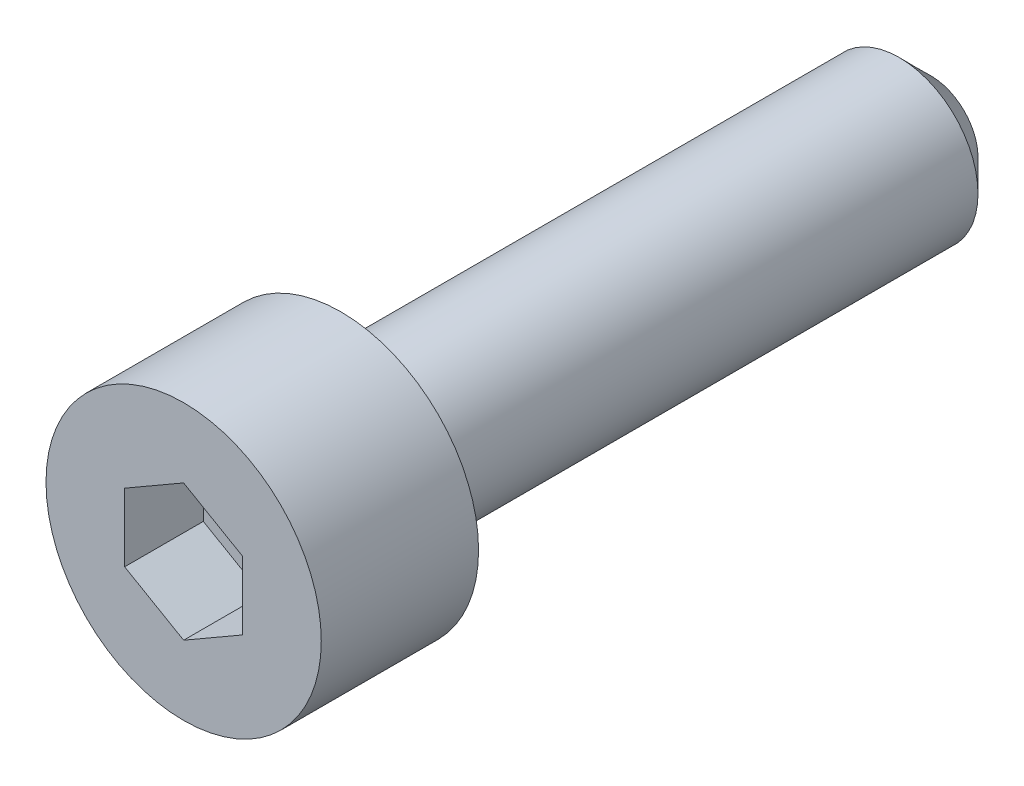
ISO-10303-21;
HEADER;
FILE_DESCRIPTION(('STEP AP214'),'2;1');
FILE_NAME('part.step','',(''),(''),'','','');
FILE_SCHEMA(('AUTOMOTIVE_DESIGN { 1 0 10303 214 1 1 1 1 }'));
ENDSEC;
DATA;
#1=APPLICATION_CONTEXT('core data for automotive mechanical design processes');
#2=APPLICATION_PROTOCOL_DEFINITION('international standard','automotive_design',2000,#1);
#3=PRODUCT_CONTEXT('',#1,'mechanical');
#4=PRODUCT('Part','Part','',(#3));
#5=PRODUCT_RELATED_PRODUCT_CATEGORY('part','',(#4));
#6=PRODUCT_DEFINITION_FORMATION('','',#4);
#7=PRODUCT_DEFINITION_CONTEXT('part definition',#1,'design');
#8=PRODUCT_DEFINITION('design','',#6,#7);
#9=PRODUCT_DEFINITION_SHAPE('','',#8);
#10=(LENGTH_UNIT() NAMED_UNIT(*) SI_UNIT(.MILLI.,.METRE.));
#11=(NAMED_UNIT(*) PLANE_ANGLE_UNIT() SI_UNIT($,.RADIAN.));
#12=(NAMED_UNIT(*) SI_UNIT($,.STERADIAN.) SOLID_ANGLE_UNIT());
#13=UNCERTAINTY_MEASURE_WITH_UNIT(LENGTH_MEASURE(1.E-05),#10,'distance_accuracy_value','');
#14=(GEOMETRIC_REPRESENTATION_CONTEXT(3) GLOBAL_UNCERTAINTY_ASSIGNED_CONTEXT((#13)) GLOBAL_UNIT_ASSIGNED_CONTEXT((#10,
#11,#12)) REPRESENTATION_CONTEXT('',''));
#15=CARTESIAN_POINT('',(0.,0.,0.));
#16=DIRECTION('',(0.,0.,1.));
#17=DIRECTION('',(1.,0.,0.));
#18=AXIS2_PLACEMENT_3D('',#15,#16,#17);
#19=CARTESIAN_POINT('',(0.,1.73205080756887,2.));
#20=DIRECTION('',(-0.5,-0.86602540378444,0.));
#21=DIRECTION('',(0.86602540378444,-0.5,0.));
#22=AXIS2_PLACEMENT_3D('',#19,#20,#21);
#23=PLANE('',#22);
#24=DIRECTION('',(0.,0.,1.));
#25=VECTOR('',#24,1.);
#26=CARTESIAN_POINT('',(1.5,0.866025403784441,2.));
#27=LINE('',#26,#25);
#28=CARTESIAN_POINT('',(1.5,0.866025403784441,2.));
#29=VERTEX_POINT('',#28);
#30=CARTESIAN_POINT('',(1.5,0.866025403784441,4.));
#31=VERTEX_POINT('',#30);
#32=EDGE_CURVE('E63',#29,#31,#27,.T.);
#33=ORIENTED_EDGE('',*,*,#32,.T.);
#34=DIRECTION('',(0.86602540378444,-0.5,0.));
#35=VECTOR('',#34,1.);
#36=CARTESIAN_POINT('',(0.,1.73205080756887,4.));
#37=LINE('',#36,#35);
#38=CARTESIAN_POINT('',(0.,1.73205080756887,4.));
#39=VERTEX_POINT('',#38);
#40=EDGE_CURVE('E29',#39,#31,#37,.T.);
#41=ORIENTED_EDGE('',*,*,#40,.F.);
#42=DIRECTION('',(0.,0.,1.));
#43=VECTOR('',#42,1.);
#44=CARTESIAN_POINT('',(0.,1.73205080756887,2.));
#45=LINE('',#44,#43);
#46=CARTESIAN_POINT('',(0.,1.73205080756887,2.));
#47=VERTEX_POINT('',#46);
#48=EDGE_CURVE('E33',#47,#39,#45,.T.);
#49=ORIENTED_EDGE('',*,*,#48,.F.);
#50=DIRECTION('',(0.86602540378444,-0.5,0.));
#51=VECTOR('',#50,1.);
#52=CARTESIAN_POINT('',(0.,1.73205080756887,2.));
#53=LINE('',#52,#51);
#54=EDGE_CURVE('E65',#47,#29,#53,.T.);
#55=ORIENTED_EDGE('',*,*,#54,.T.);
#56=EDGE_LOOP('',(#33,#41,#49,#55));
#57=FACE_BOUND('',#56,.T.);
#58=ADVANCED_FACE('F14',(#57),#23,.T.);
#59=CARTESIAN_POINT('',(1.5,-0.866025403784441,2.));
#60=DIRECTION('',(1.,0.,0.));
#61=DIRECTION('',(0.,1.,0.));
#62=AXIS2_PLACEMENT_3D('',#59,#60,#61);
#63=PLANE('',#62);
#64=DIRECTION('',(0.,0.,1.));
#65=VECTOR('',#64,1.);
#66=CARTESIAN_POINT('',(1.5,-0.866025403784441,2.));
#67=LINE('',#66,#65);
#68=CARTESIAN_POINT('',(1.5,-0.866025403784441,2.));
#69=VERTEX_POINT('',#68);
#70=CARTESIAN_POINT('',(1.5,-0.866025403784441,4.));
#71=VERTEX_POINT('',#70);
#72=EDGE_CURVE('E70',#69,#71,#67,.T.);
#73=ORIENTED_EDGE('',*,*,#72,.T.);
#74=DIRECTION('',(0.,1.,0.));
#75=VECTOR('',#74,1.);
#76=CARTESIAN_POINT('',(1.5,-0.866025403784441,4.));
#77=LINE('',#76,#75);
#78=EDGE_CURVE('E73',#71,#31,#77,.T.);
#79=ORIENTED_EDGE('',*,*,#78,.T.);
#80=ORIENTED_EDGE('',*,*,#32,.F.);
#81=DIRECTION('',(0.,1.,0.));
#82=VECTOR('',#81,1.);
#83=CARTESIAN_POINT('',(1.5,-0.866025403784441,2.));
#84=LINE('',#83,#82);
#85=EDGE_CURVE('E100',#69,#29,#84,.T.);
#86=ORIENTED_EDGE('',*,*,#85,.F.);
#87=EDGE_LOOP('',(#73,#79,#80,#86));
#88=FACE_BOUND('',#87,.T.);
#89=ADVANCED_FACE('F74',(#88),#63,.F.);
#90=CARTESIAN_POINT('',(0.,-1.73205080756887,2.));
#91=DIRECTION('',(0.5,-0.86602540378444,0.));
#92=DIRECTION('',(0.86602540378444,0.5,0.));
#93=AXIS2_PLACEMENT_3D('',#90,#91,#92);
#94=PLANE('',#93);
#95=DIRECTION('',(0.,0.,1.));
#96=VECTOR('',#95,1.);
#97=CARTESIAN_POINT('',(0.,-1.73205080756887,2.));
#98=LINE('',#97,#96);
#99=CARTESIAN_POINT('',(0.,-1.73205080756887,2.));
#100=VERTEX_POINT('',#99);
#101=CARTESIAN_POINT('',(0.,-1.73205080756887,4.));
#102=VERTEX_POINT('',#101);
#103=EDGE_CURVE('E108',#100,#102,#98,.T.);
#104=ORIENTED_EDGE('',*,*,#103,.T.);
#105=DIRECTION('',(0.86602540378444,0.5,0.));
#106=VECTOR('',#105,1.);
#107=CARTESIAN_POINT('',(0.,-1.73205080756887,4.));
#108=LINE('',#107,#106);
#109=EDGE_CURVE('E78',#102,#71,#108,.T.);
#110=ORIENTED_EDGE('',*,*,#109,.T.);
#111=ORIENTED_EDGE('',*,*,#72,.F.);
#112=DIRECTION('',(0.86602540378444,0.5,0.));
#113=VECTOR('',#112,1.);
#114=CARTESIAN_POINT('',(0.,-1.73205080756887,2.));
#115=LINE('',#114,#113);
#116=EDGE_CURVE('E97',#100,#69,#115,.T.);
#117=ORIENTED_EDGE('',*,*,#116,.F.);
#118=EDGE_LOOP('',(#104,#110,#111,#117));
#119=FACE_BOUND('',#118,.T.);
#120=ADVANCED_FACE('F139',(#119),#94,.F.);
#121=CARTESIAN_POINT('',(0.,-1.73205080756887,2.));
#122=DIRECTION('',(0.5,0.86602540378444,0.));
#123=DIRECTION('',(-0.86602540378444,0.5,0.));
#124=AXIS2_PLACEMENT_3D('',#121,#122,#123);
#125=PLANE('',#124);
#126=DIRECTION('',(0.,0.,1.));
#127=VECTOR('',#126,1.);
#128=CARTESIAN_POINT('',(-1.5,-0.866025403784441,2.));
#129=LINE('',#128,#127);
#130=CARTESIAN_POINT('',(-1.5,-0.866025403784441,2.));
#131=VERTEX_POINT('',#130);
#132=CARTESIAN_POINT('',(-1.5,-0.866025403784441,4.));
#133=VERTEX_POINT('',#132);
#134=EDGE_CURVE('E106',#131,#133,#129,.T.);
#135=ORIENTED_EDGE('',*,*,#134,.T.);
#136=DIRECTION('',(-0.86602540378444,0.5,0.));
#137=VECTOR('',#136,1.);
#138=CARTESIAN_POINT('',(0.,-1.73205080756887,4.));
#139=LINE('',#138,#137);
#140=EDGE_CURVE('E185',#102,#133,#139,.T.);
#141=ORIENTED_EDGE('',*,*,#140,.F.);
#142=ORIENTED_EDGE('',*,*,#103,.F.);
#143=DIRECTION('',(-0.86602540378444,0.5,0.));
#144=VECTOR('',#143,1.);
#145=CARTESIAN_POINT('',(0.,-1.73205080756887,2.));
#146=LINE('',#145,#144);
#147=EDGE_CURVE('E94',#100,#131,#146,.T.);
#148=ORIENTED_EDGE('',*,*,#147,.T.);
#149=EDGE_LOOP('',(#135,#141,#142,#148));
#150=FACE_BOUND('',#149,.T.);
#151=ADVANCED_FACE('F151',(#150),#125,.T.);
#152=CARTESIAN_POINT('',(-1.5,0.866025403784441,2.));
#153=DIRECTION('',(-1.,0.,0.));
#154=DIRECTION('',(0.,-1.,0.));
#155=AXIS2_PLACEMENT_3D('',#152,#153,#154);
#156=PLANE('',#155);
#157=DIRECTION('',(0.,0.,1.));
#158=VECTOR('',#157,1.);
#159=CARTESIAN_POINT('',(-1.5,0.866025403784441,2.));
#160=LINE('',#159,#158);
#161=CARTESIAN_POINT('',(-1.5,0.866025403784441,2.));
#162=VERTEX_POINT('',#161);
#163=CARTESIAN_POINT('',(-1.5,0.866025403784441,4.));
#164=VERTEX_POINT('',#163);
#165=EDGE_CURVE('E104',#162,#164,#160,.T.);
#166=ORIENTED_EDGE('',*,*,#165,.T.);
#167=DIRECTION('',(0.,-1.,0.));
#168=VECTOR('',#167,1.);
#169=CARTESIAN_POINT('',(-1.5,0.866025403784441,4.));
#170=LINE('',#169,#168);
#171=EDGE_CURVE('E186',#164,#133,#170,.T.);
#172=ORIENTED_EDGE('',*,*,#171,.T.);
#173=ORIENTED_EDGE('',*,*,#134,.F.);
#174=DIRECTION('',(0.,-1.,0.));
#175=VECTOR('',#174,1.);
#176=CARTESIAN_POINT('',(-1.5,0.866025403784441,2.));
#177=LINE('',#176,#175);
#178=EDGE_CURVE('E91',#162,#131,#177,.T.);
#179=ORIENTED_EDGE('',*,*,#178,.F.);
#180=EDGE_LOOP('',(#166,#172,#173,#179));
#181=FACE_BOUND('',#180,.T.);
#182=ADVANCED_FACE('F147',(#181),#156,.F.);
#183=CARTESIAN_POINT('',(0.,1.73205080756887,2.));
#184=DIRECTION('',(-0.5,0.86602540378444,0.));
#185=DIRECTION('',(-0.86602540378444,-0.5,0.));
#186=AXIS2_PLACEMENT_3D('',#183,#184,#185);
#187=PLANE('',#186);
#188=DIRECTION('',(-0.86602540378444,-0.5,0.));
#189=VECTOR('',#188,1.);
#190=CARTESIAN_POINT('',(0.,1.73205080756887,2.));
#191=LINE('',#190,#189);
#192=EDGE_CURVE('E88',#47,#162,#191,.T.);
#193=ORIENTED_EDGE('',*,*,#192,.F.);
#194=ORIENTED_EDGE('',*,*,#48,.T.);
#195=DIRECTION('',(-0.86602540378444,-0.5,0.));
#196=VECTOR('',#195,1.);
#197=CARTESIAN_POINT('',(0.,1.73205080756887,4.));
#198=LINE('',#197,#196);
#199=EDGE_CURVE('E84',#39,#164,#198,.T.);
#200=ORIENTED_EDGE('',*,*,#199,.T.);
#201=ORIENTED_EDGE('',*,*,#165,.F.);
#202=EDGE_LOOP('',(#193,#194,#200,#201));
#203=FACE_BOUND('',#202,.T.);
#204=ADVANCED_FACE('F144',(#203),#187,.F.);
#205=CARTESIAN_POINT('',(1.5,0.866025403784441,2.));
#206=DIRECTION('',(0.,0.,1.));
#207=DIRECTION('',(1.,0.,0.));
#208=AXIS2_PLACEMENT_3D('',#205,#206,#207);
#209=PLANE('',#208);
#210=ORIENTED_EDGE('',*,*,#54,.F.);
#211=ORIENTED_EDGE('',*,*,#192,.T.);
#212=ORIENTED_EDGE('',*,*,#178,.T.);
#213=ORIENTED_EDGE('',*,*,#147,.F.);
#214=ORIENTED_EDGE('',*,*,#116,.T.);
#215=ORIENTED_EDGE('',*,*,#85,.T.);
#216=EDGE_LOOP('',(#210,#211,#212,#213,#214,#215));
#217=FACE_BOUND('',#216,.T.);
#218=ADVANCED_FACE('F143',(#217),#209,.T.);
#219=CARTESIAN_POINT('',(0.,0.,4.));
#220=DIRECTION('',(0.,0.,1.));
#221=DIRECTION('',(1.,0.,0.));
#222=AXIS2_PLACEMENT_3D('',#219,#220,#221);
#223=PLANE('',#222);
#224=CARTESIAN_POINT('',(0.,0.,4.));
#225=DIRECTION('',(0.,0.,1.));
#226=DIRECTION('',(1.,0.,0.));
#227=AXIS2_PLACEMENT_3D('',#224,#225,#226);
#228=CIRCLE('',#227,3.5);
#229=CARTESIAN_POINT('',(3.5,0.,4.));
#230=VERTEX_POINT('',#229);
#231=EDGE_CURVE('E116',#230,#230,#228,.T.);
#232=ORIENTED_EDGE('',*,*,#231,.T.);
#233=EDGE_LOOP('',(#232));
#234=FACE_BOUND('',#233,.T.);
#235=ORIENTED_EDGE('',*,*,#199,.F.);
#236=ORIENTED_EDGE('',*,*,#40,.T.);
#237=ORIENTED_EDGE('',*,*,#78,.F.);
#238=ORIENTED_EDGE('',*,*,#109,.F.);
#239=ORIENTED_EDGE('',*,*,#140,.T.);
#240=ORIENTED_EDGE('',*,*,#171,.F.);
#241=EDGE_LOOP('',(#235,#236,#237,#238,#239,#240));
#242=FACE_BOUND('',#241,.T.);
#243=ADVANCED_FACE('F81',(#234,#242),#223,.T.);
#244=CARTESIAN_POINT('',(0.,0.,5.));
#245=DIRECTION('',(0.,0.,1.));
#246=DIRECTION('',(1.,0.,0.));
#247=AXIS2_PLACEMENT_3D('',#244,#245,#246);
#248=CYLINDRICAL_SURFACE('',#247,3.5);
#249=CARTESIAN_POINT('',(0.,0.,0.));
#250=DIRECTION('',(0.,0.,1.));
#251=DIRECTION('',(1.,0.,0.));
#252=AXIS2_PLACEMENT_3D('',#249,#250,#251);
#253=CIRCLE('',#252,3.5);
#254=CARTESIAN_POINT('',(3.5,0.,0.));
#255=VERTEX_POINT('',#254);
#256=EDGE_CURVE('E113',#255,#255,#253,.T.);
#257=ORIENTED_EDGE('',*,*,#256,.T.);
#258=EDGE_LOOP('',(#257));
#259=FACE_BOUND('',#258,.T.);
#260=ORIENTED_EDGE('',*,*,#231,.F.);
#261=EDGE_LOOP('',(#260));
#262=FACE_BOUND('',#261,.T.);
#263=ADVANCED_FACE('F164',(#259,#262),#248,.T.);
#264=CARTESIAN_POINT('',(3.5,0.,0.));
#265=DIRECTION('',(0.,0.,-1.));
#266=DIRECTION('',(-1.,0.,0.));
#267=AXIS2_PLACEMENT_3D('',#264,#265,#266);
#268=PLANE('',#267);
#269=CARTESIAN_POINT('',(0.,0.,0.));
#270=DIRECTION('',(0.,0.,1.));
#271=DIRECTION('',(1.,0.,0.));
#272=AXIS2_PLACEMENT_3D('',#269,#270,#271);
#273=CIRCLE('',#272,2.);
#274=CARTESIAN_POINT('',(2.,0.,0.));
#275=VERTEX_POINT('',#274);
#276=EDGE_CURVE('E69',#275,#275,#273,.T.);
#277=ORIENTED_EDGE('',*,*,#276,.T.);
#278=EDGE_LOOP('',(#277));
#279=FACE_BOUND('',#278,.T.);
#280=ORIENTED_EDGE('',*,*,#256,.F.);
#281=EDGE_LOOP('',(#280));
#282=FACE_BOUND('',#281,.T.);
#283=ADVANCED_FACE('F161',(#279,#282),#268,.T.);
#284=CARTESIAN_POINT('',(0.,0.,5.));
#285=DIRECTION('',(0.,0.,1.));
#286=DIRECTION('',(1.,0.,0.));
#287=AXIS2_PLACEMENT_3D('',#284,#285,#286);
#288=CYLINDRICAL_SURFACE('',#287,2.);
#289=CARTESIAN_POINT('',(0.,0.,-14.2));
#290=DIRECTION('',(0.,0.,-1.));
#291=DIRECTION('',(-1.,0.,0.));
#292=AXIS2_PLACEMENT_3D('',#289,#290,#291);
#293=CIRCLE('',#292,2.);
#294=CARTESIAN_POINT('',(-2.,0.,-14.2));
#295=VERTEX_POINT('',#294);
#296=EDGE_CURVE('E22',#295,#295,#293,.F.);
#297=ORIENTED_EDGE('',*,*,#296,.T.);
#298=EDGE_LOOP('',(#297));
#299=FACE_BOUND('',#298,.T.);
#300=ORIENTED_EDGE('',*,*,#276,.F.);
#301=EDGE_LOOP('',(#300));
#302=FACE_BOUND('',#301,.T.);
#303=ADVANCED_FACE('F121',(#299,#302),#288,.T.);
#304=CARTESIAN_POINT('',(2.,0.,-15.));
#305=DIRECTION('',(0.,0.,-1.));
#306=DIRECTION('',(-1.,0.,0.));
#307=AXIS2_PLACEMENT_3D('',#304,#305,#306);
#308=PLANE('',#307);
#309=CARTESIAN_POINT('',(0.,0.,-15.));
#310=DIRECTION('',(0.,0.,-1.));
#311=DIRECTION('',(-1.,0.,0.));
#312=AXIS2_PLACEMENT_3D('',#309,#310,#311);
#313=CIRCLE('',#312,1.2);
#314=CARTESIAN_POINT('',(-1.2,0.,-15.));
#315=VERTEX_POINT('',#314);
#316=EDGE_CURVE('E9',#315,#315,#313,.T.);
#317=ORIENTED_EDGE('',*,*,#316,.T.);
#318=EDGE_LOOP('',(#317));
#319=FACE_BOUND('',#318,.T.);
#320=ADVANCED_FACE('F125',(#319),#308,.T.);
#321=CARTESIAN_POINT('',(0.,0.,-14.2));
#322=DIRECTION('',(0.,0.,1.));
#323=DIRECTION('',(1.,0.,0.));
#324=AXIS2_PLACEMENT_3D('',#321,#322,#323);
#325=CONICAL_SURFACE('',#324,2.,0.785398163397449);
#326=ORIENTED_EDGE('',*,*,#316,.F.);
#327=EDGE_LOOP('',(#326));
#328=FACE_BOUND('',#327,.T.);
#329=ORIENTED_EDGE('',*,*,#296,.F.);
#330=EDGE_LOOP('',(#329));
#331=FACE_BOUND('',#330,.T.);
#332=ADVANCED_FACE('F16',(#328,#331),#325,.T.);
#333=CLOSED_SHELL('',(#58,#89,#120,#151,#182,#204,#218,#243,#263,#283,#303,#320,#332));
#334=MANIFOLD_SOLID_BREP('B1',#333);
#335=ADVANCED_BREP_SHAPE_REPRESENTATION('',(#18,#334),#14);
#336=SHAPE_DEFINITION_REPRESENTATION(#9,#335);
ENDSEC;
END-ISO-10303-21;
